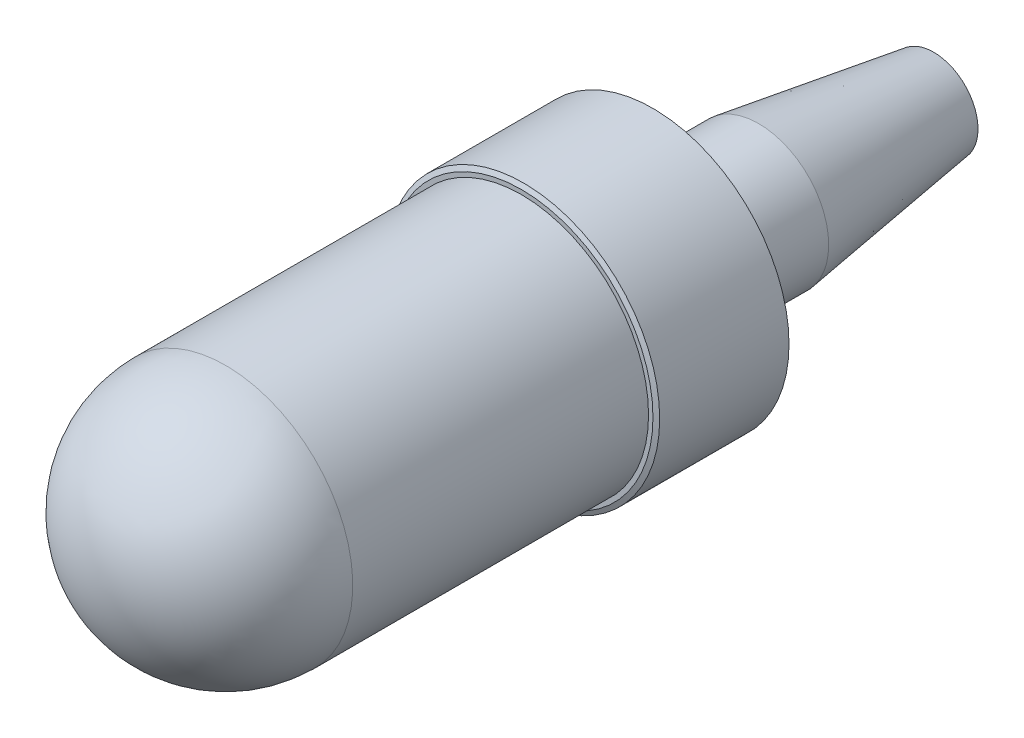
ISO-10303-21;
HEADER;
FILE_DESCRIPTION(('STEP AP214'),'2;1');
FILE_NAME('part.step','',(''),(''),'','','');
FILE_SCHEMA(('AUTOMOTIVE_DESIGN { 1 0 10303 214 1 1 1 1 }'));
ENDSEC;
DATA;
#1=APPLICATION_CONTEXT('core data for automotive mechanical design processes');
#2=APPLICATION_PROTOCOL_DEFINITION('international standard','automotive_design',2000,#1);
#3=PRODUCT_CONTEXT('',#1,'mechanical');
#4=PRODUCT('Part','Part','',(#3));
#5=PRODUCT_RELATED_PRODUCT_CATEGORY('part','',(#4));
#6=PRODUCT_DEFINITION_FORMATION('','',#4);
#7=PRODUCT_DEFINITION_CONTEXT('part definition',#1,'design');
#8=PRODUCT_DEFINITION('design','',#6,#7);
#9=PRODUCT_DEFINITION_SHAPE('','',#8);
#10=(LENGTH_UNIT() NAMED_UNIT(*) SI_UNIT(.MILLI.,.METRE.));
#11=(NAMED_UNIT(*) PLANE_ANGLE_UNIT() SI_UNIT($,.RADIAN.));
#12=(NAMED_UNIT(*) SI_UNIT($,.STERADIAN.) SOLID_ANGLE_UNIT());
#13=UNCERTAINTY_MEASURE_WITH_UNIT(LENGTH_MEASURE(1.E-05),#10,'distance_accuracy_value','');
#14=(GEOMETRIC_REPRESENTATION_CONTEXT(3) GLOBAL_UNCERTAINTY_ASSIGNED_CONTEXT((#13)) GLOBAL_UNIT_ASSIGNED_CONTEXT((#10,
#11,#12)) REPRESENTATION_CONTEXT('',''));
#15=CARTESIAN_POINT('',(0.,0.,0.));
#16=DIRECTION('',(0.,0.,1.));
#17=DIRECTION('',(1.,0.,0.));
#18=AXIS2_PLACEMENT_3D('',#15,#16,#17);
#19=CARTESIAN_POINT('',(3.33066907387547E-13,0.,23.749));
#20=DIRECTION('',(0.,0.,-1.));
#21=DIRECTION('',(-1.,0.,0.));
#22=AXIS2_PLACEMENT_3D('',#19,#20,#21);
#23=CYLINDRICAL_SURFACE('',#22,24.1935);
#24=CARTESIAN_POINT('',(0.,0.,0.380999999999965));
#25=DIRECTION('',(0.,0.,1.));
#26=DIRECTION('',(1.,0.,0.));
#27=AXIS2_PLACEMENT_3D('',#24,#25,#26);
#28=CIRCLE('',#27,24.1935);
#29=CARTESIAN_POINT('',(24.1935,0.,0.380999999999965));
#30=VERTEX_POINT('',#29);
#31=EDGE_CURVE('E45',#30,#30,#28,.T.);
#32=ORIENTED_EDGE('',*,*,#31,.T.);
#33=EDGE_LOOP('',(#32));
#34=FACE_BOUND('',#33,.T.);
#35=CARTESIAN_POINT('',(3.33066907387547E-13,0.,23.368));
#36=DIRECTION('',(0.,0.,1.));
#37=DIRECTION('',(1.,0.,0.));
#38=AXIS2_PLACEMENT_3D('',#35,#36,#37);
#39=CIRCLE('',#38,24.1935);
#40=CARTESIAN_POINT('',(24.1935000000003,0.,23.368));
#41=VERTEX_POINT('',#40);
#42=EDGE_CURVE('E49',#41,#41,#39,.F.);
#43=ORIENTED_EDGE('',*,*,#42,.T.);
#44=EDGE_LOOP('',(#43));
#45=FACE_BOUND('',#44,.T.);
#46=ADVANCED_FACE('F35',(#34,#45),#23,.T.);
#47=CARTESIAN_POINT('',(3.33066907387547E-13,0.,23.749));
#48=DIRECTION('',(0.,0.,1.));
#49=DIRECTION('',(1.,0.,0.));
#50=AXIS2_PLACEMENT_3D('',#47,#48,#49);
#51=PLANE('',#50);
#52=CARTESIAN_POINT('',(3.33066907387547E-13,0.,23.749));
#53=DIRECTION('',(0.,0.,1.));
#54=DIRECTION('',(1.,0.,0.));
#55=AXIS2_PLACEMENT_3D('',#52,#53,#54);
#56=CIRCLE('',#55,22.5933);
#57=CARTESIAN_POINT('',(22.5933000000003,0.,23.749));
#58=VERTEX_POINT('',#57);
#59=EDGE_CURVE('E10',#58,#58,#56,.T.);
#60=ORIENTED_EDGE('',*,*,#59,.F.);
#61=EDGE_LOOP('',(#60));
#62=FACE_BOUND('',#61,.T.);
#63=CARTESIAN_POINT('',(3.33066907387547E-13,0.,23.749));
#64=DIRECTION('',(0.,0.,1.));
#65=DIRECTION('',(1.,0.,0.));
#66=AXIS2_PLACEMENT_3D('',#63,#64,#65);
#67=CIRCLE('',#66,23.3764428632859);
#68=CARTESIAN_POINT('',(23.3764428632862,0.,23.749));
#69=VERTEX_POINT('',#68);
#70=EDGE_CURVE('E54',#69,#69,#67,.T.);
#71=ORIENTED_EDGE('',*,*,#70,.T.);
#72=EDGE_LOOP('',(#71));
#73=FACE_BOUND('',#72,.T.);
#74=ADVANCED_FACE('F94',(#62,#73),#51,.T.);
#75=CARTESIAN_POINT('',(0.,0.,0.));
#76=DIRECTION('',(0.,0.,1.));
#77=DIRECTION('',(1.,0.,0.));
#78=AXIS2_PLACEMENT_3D('',#75,#76,#77);
#79=PLANE('',#78);
#80=CARTESIAN_POINT('',(-18.8976000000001,0.,0.));
#81=DIRECTION('',(0.,0.,-1.));
#82=DIRECTION('',(1.,0.,0.));
#83=AXIS2_PLACEMENT_3D('',#80,#81,#82);
#84=CIRCLE('',#83,2.2225);
#85=CARTESIAN_POINT('',(-16.6751000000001,0.,0.));
#86=VERTEX_POINT('',#85);
#87=EDGE_CURVE('E84',#86,#86,#84,.T.);
#88=ORIENTED_EDGE('',*,*,#87,.F.);
#89=EDGE_LOOP('',(#88));
#90=FACE_BOUND('',#89,.T.);
#91=CARTESIAN_POINT('',(18.8976,0.,0.));
#92=DIRECTION('',(0.,0.,-1.));
#93=DIRECTION('',(-1.,0.,0.));
#94=AXIS2_PLACEMENT_3D('',#91,#92,#93);
#95=CIRCLE('',#94,2.2225);
#96=CARTESIAN_POINT('',(16.6751,0.,0.));
#97=VERTEX_POINT('',#96);
#98=EDGE_CURVE('E78',#97,#97,#95,.T.);
#99=ORIENTED_EDGE('',*,*,#98,.F.);
#100=EDGE_LOOP('',(#99));
#101=FACE_BOUND('',#100,.T.);
#102=CARTESIAN_POINT('',(0.,0.,0.));
#103=DIRECTION('',(0.,0.,1.));
#104=DIRECTION('',(1.,0.,0.));
#105=AXIS2_PLACEMENT_3D('',#102,#103,#104);
#106=CIRCLE('',#105,12.446);
#107=CARTESIAN_POINT('',(12.446,0.,0.));
#108=VERTEX_POINT('',#107);
#109=EDGE_CURVE('E66',#108,#108,#106,.T.);
#110=ORIENTED_EDGE('',*,*,#109,.T.);
#111=EDGE_LOOP('',(#110));
#112=FACE_BOUND('',#111,.T.);
#113=CARTESIAN_POINT('',(0.,0.,0.));
#114=DIRECTION('',(0.,0.,1.));
#115=DIRECTION('',(1.,0.,0.));
#116=AXIS2_PLACEMENT_3D('',#113,#114,#115);
#117=CIRCLE('',#116,23.3764428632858);
#118=CARTESIAN_POINT('',(23.3764428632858,0.,0.));
#119=VERTEX_POINT('',#118);
#120=EDGE_CURVE('E41',#119,#119,#117,.F.);
#121=ORIENTED_EDGE('',*,*,#120,.T.);
#122=EDGE_LOOP('',(#121));
#123=FACE_BOUND('',#122,.T.);
#124=ADVANCED_FACE('F90',(#90,#101,#112,#123),#79,.F.);
#125=CARTESIAN_POINT('',(3.33066907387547E-13,0.,23.749));
#126=DIRECTION('',(0.,0.,-1.));
#127=DIRECTION('',(-1.,0.,0.));
#128=AXIS2_PLACEMENT_3D('',#125,#126,#127);
#129=CONICAL_SURFACE('',#128,23.3764428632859,1.13446401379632);
#130=ORIENTED_EDGE('',*,*,#42,.F.);
#131=EDGE_LOOP('',(#130));
#132=FACE_BOUND('',#131,.T.);
#133=ORIENTED_EDGE('',*,*,#70,.F.);
#134=EDGE_LOOP('',(#133));
#135=FACE_BOUND('',#134,.T.);
#136=ADVANCED_FACE('F93',(#132,#135),#129,.T.);
#137=CARTESIAN_POINT('',(0.,0.,0.380999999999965));
#138=DIRECTION('',(0.,0.,1.));
#139=DIRECTION('',(1.,0.,0.));
#140=AXIS2_PLACEMENT_3D('',#137,#138,#139);
#141=CONICAL_SURFACE('',#140,24.1935,1.13446401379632);
#142=ORIENTED_EDGE('',*,*,#120,.F.);
#143=EDGE_LOOP('',(#142));
#144=FACE_BOUND('',#143,.T.);
#145=ORIENTED_EDGE('',*,*,#31,.F.);
#146=EDGE_LOOP('',(#145));
#147=FACE_BOUND('',#146,.T.);
#148=ADVANCED_FACE('F128',(#144,#147),#141,.T.);
#149=CARTESIAN_POINT('',(0.,0.,0.));
#150=DIRECTION('',(0.,0.,-1.));
#151=DIRECTION('',(-1.,0.,0.));
#152=AXIS2_PLACEMENT_3D('',#149,#150,#151);
#153=CYLINDRICAL_SURFACE('',#152,22.5933);
#154=CARTESIAN_POINT('',(-5.55111512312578E-13,0.,76.327));
#155=DIRECTION('',(0.,0.,-1.));
#156=DIRECTION('',(-1.,0.,0.));
#157=AXIS2_PLACEMENT_3D('',#154,#155,#156);
#158=CIRCLE('',#157,22.5933);
#159=CARTESIAN_POINT('',(-22.5933000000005,0.,76.327));
#160=VERTEX_POINT('',#159);
#161=EDGE_CURVE('E63',#160,#160,#158,.T.);
#162=ORIENTED_EDGE('',*,*,#161,.T.);
#163=EDGE_LOOP('',(#162));
#164=FACE_BOUND('',#163,.T.);
#165=ORIENTED_EDGE('',*,*,#59,.T.);
#166=EDGE_LOOP('',(#165));
#167=FACE_BOUND('',#166,.T.);
#168=ADVANCED_FACE('F113',(#164,#167),#153,.T.);
#169=CARTESIAN_POINT('',(-4.44089209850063E-13,0.,76.327));
#170=DIRECTION('',(0.,0.,-1.));
#171=DIRECTION('',(-1.,0.,0.));
#172=AXIS2_PLACEMENT_3D('',#169,#170,#171);
#173=SPHERICAL_SURFACE('',#172,22.5933);
#174=ORIENTED_EDGE('',*,*,#161,.F.);
#175=EDGE_LOOP('',(#174));
#176=FACE_BOUND('',#175,.T.);
#177=ADVANCED_FACE('F103',(#176),#173,.T.);
#178=CARTESIAN_POINT('',(0.,0.,0.));
#179=DIRECTION('',(0.,0.,1.));
#180=DIRECTION('',(1.,0.,0.));
#181=AXIS2_PLACEMENT_3D('',#178,#179,#180);
#182=CYLINDRICAL_SURFACE('',#181,12.446);
#183=CARTESIAN_POINT('',(0.,0.,-18.4150000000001));
#184=DIRECTION('',(0.,0.,1.));
#185=DIRECTION('',(1.,0.,0.));
#186=AXIS2_PLACEMENT_3D('',#183,#184,#185);
#187=CIRCLE('',#186,12.446);
#188=CARTESIAN_POINT('',(12.446,0.,-18.4150000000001));
#189=VERTEX_POINT('',#188);
#190=EDGE_CURVE('E69',#189,#189,#187,.T.);
#191=ORIENTED_EDGE('',*,*,#190,.T.);
#192=EDGE_LOOP('',(#191));
#193=FACE_BOUND('',#192,.T.);
#194=ORIENTED_EDGE('',*,*,#109,.F.);
#195=EDGE_LOOP('',(#194));
#196=FACE_BOUND('',#195,.T.);
#197=ADVANCED_FACE('F100',(#193,#196),#182,.T.);
#198=CARTESIAN_POINT('',(0.,0.,-18.4150000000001));
#199=DIRECTION('',(0.,0.,1.));
#200=DIRECTION('',(1.,0.,0.));
#201=AXIS2_PLACEMENT_3D('',#198,#199,#200);
#202=CONICAL_SURFACE('',#201,12.446,0.145894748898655);
#203=CARTESIAN_POINT('',(-5.55111512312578E-13,0.,-49.5300000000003));
#204=DIRECTION('',(0.,0.,1.));
#205=DIRECTION('',(1.,0.,0.));
#206=AXIS2_PLACEMENT_3D('',#203,#204,#205);
#207=CIRCLE('',#206,7.874);
#208=CARTESIAN_POINT('',(7.87399999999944,0.,-49.5300000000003));
#209=VERTEX_POINT('',#208);
#210=EDGE_CURVE('E72',#209,#209,#207,.T.);
#211=ORIENTED_EDGE('',*,*,#210,.T.);
#212=EDGE_LOOP('',(#211));
#213=FACE_BOUND('',#212,.T.);
#214=ORIENTED_EDGE('',*,*,#190,.F.);
#215=EDGE_LOOP('',(#214));
#216=FACE_BOUND('',#215,.T.);
#217=ADVANCED_FACE('F102',(#213,#216),#202,.T.);
#218=CARTESIAN_POINT('',(7.87399999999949,0.,-49.5300000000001));
#219=DIRECTION('',(0.,0.,-1.));
#220=DIRECTION('',(-1.,0.,0.));
#221=AXIS2_PLACEMENT_3D('',#218,#219,#220);
#222=PLANE('',#221);
#223=ORIENTED_EDGE('',*,*,#210,.F.);
#224=EDGE_LOOP('',(#223));
#225=FACE_BOUND('',#224,.T.);
#226=ADVANCED_FACE('F110',(#225),#222,.T.);
#227=CARTESIAN_POINT('',(18.8976,0.,9.52500000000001));
#228=DIRECTION('',(0.,0.,-1.));
#229=DIRECTION('',(-1.,0.,0.));
#230=AXIS2_PLACEMENT_3D('',#227,#228,#229);
#231=CYLINDRICAL_SURFACE('',#230,2.2225);
#232=CARTESIAN_POINT('',(18.8976,0.,9.52500000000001));
#233=DIRECTION('',(0.,0.,-1.));
#234=DIRECTION('',(-1.,0.,0.));
#235=AXIS2_PLACEMENT_3D('',#232,#233,#234);
#236=CIRCLE('',#235,2.2225);
#237=CARTESIAN_POINT('',(16.6751,0.,9.52500000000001));
#238=VERTEX_POINT('',#237);
#239=EDGE_CURVE('E75',#238,#238,#236,.T.);
#240=ORIENTED_EDGE('',*,*,#239,.F.);
#241=EDGE_LOOP('',(#240));
#242=FACE_BOUND('',#241,.T.);
#243=ORIENTED_EDGE('',*,*,#98,.T.);
#244=EDGE_LOOP('',(#243));
#245=FACE_BOUND('',#244,.T.);
#246=ADVANCED_FACE('F187',(#242,#245),#231,.F.);
#247=CARTESIAN_POINT('',(18.8976,0.,9.52500000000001));
#248=DIRECTION('',(0.,0.,-1.));
#249=DIRECTION('',(-1.,0.,0.));
#250=AXIS2_PLACEMENT_3D('',#247,#248,#249);
#251=PLANE('',#250);
#252=ORIENTED_EDGE('',*,*,#239,.T.);
#253=EDGE_LOOP('',(#252));
#254=FACE_BOUND('',#253,.T.);
#255=ADVANCED_FACE('F197',(#254),#251,.T.);
#256=CARTESIAN_POINT('',(-18.8975999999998,0.,9.52500000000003));
#257=DIRECTION('',(0.,0.,-1.));
#258=DIRECTION('',(-1.,0.,0.));
#259=AXIS2_PLACEMENT_3D('',#256,#257,#258);
#260=CYLINDRICAL_SURFACE('',#259,2.2225);
#261=CARTESIAN_POINT('',(-18.8975999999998,0.,9.52500000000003));
#262=DIRECTION('',(0.,0.,-1.));
#263=DIRECTION('',(1.,0.,0.));
#264=AXIS2_PLACEMENT_3D('',#261,#262,#263);
#265=CIRCLE('',#264,2.2225);
#266=CARTESIAN_POINT('',(-16.6750999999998,0.,9.52500000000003));
#267=VERTEX_POINT('',#266);
#268=EDGE_CURVE('E81',#267,#267,#265,.T.);
#269=ORIENTED_EDGE('',*,*,#268,.F.);
#270=EDGE_LOOP('',(#269));
#271=FACE_BOUND('',#270,.T.);
#272=ORIENTED_EDGE('',*,*,#87,.T.);
#273=EDGE_LOOP('',(#272));
#274=FACE_BOUND('',#273,.T.);
#275=ADVANCED_FACE('F88',(#271,#274),#260,.F.);
#276=CARTESIAN_POINT('',(-18.8975999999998,0.,9.52500000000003));
#277=DIRECTION('',(0.,0.,1.));
#278=DIRECTION('',(1.,0.,0.));
#279=AXIS2_PLACEMENT_3D('',#276,#277,#278);
#280=PLANE('',#279);
#281=ORIENTED_EDGE('',*,*,#268,.T.);
#282=EDGE_LOOP('',(#281));
#283=FACE_BOUND('',#282,.T.);
#284=ADVANCED_FACE('F216',(#283),#280,.F.);
#285=CLOSED_SHELL('',(#46,#74,#124,#136,#148,#168,#177,#197,#217,#226,#246,#255,#275,#284));
#286=CARTESIAN_POINT('',(-4.44089209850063E-13,0.,76.327));
#287=DIRECTION('',(0.,0.,-1.));
#288=DIRECTION('',(-1.,0.,0.));
#289=AXIS2_PLACEMENT_3D('',#286,#287,#288);
#290=SPHERICAL_SURFACE('',#289,21.3233);
#291=CARTESIAN_POINT('',(-5.55111512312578E-13,0.,76.327));
#292=DIRECTION('',(0.,0.,-1.));
#293=DIRECTION('',(-1.,0.,0.));
#294=AXIS2_PLACEMENT_3D('',#291,#292,#293);
#295=CIRCLE('',#294,21.3233);
#296=CARTESIAN_POINT('',(-21.3233000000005,0.,76.327));
#297=VERTEX_POINT('',#296);
#298=EDGE_CURVE('E57',#297,#297,#295,.T.);
#299=ORIENTED_EDGE('',*,*,#298,.T.);
#300=EDGE_LOOP('',(#299));
#301=FACE_BOUND('',#300,.T.);
#302=ADVANCED_FACE('F138',(#301),#290,.F.);
#303=CARTESIAN_POINT('',(0.,0.,0.));
#304=DIRECTION('',(0.,0.,-1.));
#305=DIRECTION('',(-1.,0.,0.));
#306=AXIS2_PLACEMENT_3D('',#303,#304,#305);
#307=CYLINDRICAL_SURFACE('',#306,21.3233);
#308=CARTESIAN_POINT('',(3.33066907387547E-13,0.,25.0189999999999));
#309=DIRECTION('',(0.,0.,-1.));
#310=DIRECTION('',(-1.,0.,0.));
#311=AXIS2_PLACEMENT_3D('',#308,#309,#310);
#312=CIRCLE('',#311,21.3233);
#313=CARTESIAN_POINT('',(-21.3232999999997,0.,25.0189999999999));
#314=VERTEX_POINT('',#313);
#315=EDGE_CURVE('E60',#314,#314,#312,.T.);
#316=ORIENTED_EDGE('',*,*,#315,.T.);
#317=EDGE_LOOP('',(#316));
#318=FACE_BOUND('',#317,.T.);
#319=ORIENTED_EDGE('',*,*,#298,.F.);
#320=EDGE_LOOP('',(#319));
#321=FACE_BOUND('',#320,.T.);
#322=ADVANCED_FACE('F141',(#318,#321),#307,.F.);
#323=CARTESIAN_POINT('',(-21.3232999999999,0.,25.0189999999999));
#324=DIRECTION('',(0.,0.,1.));
#325=DIRECTION('',(1.,0.,0.));
#326=AXIS2_PLACEMENT_3D('',#323,#324,#325);
#327=PLANE('',#326);
#328=ORIENTED_EDGE('',*,*,#315,.F.);
#329=EDGE_LOOP('',(#328));
#330=FACE_BOUND('',#329,.T.);
#331=ADVANCED_FACE('F146',(#330),#327,.T.);
#332=CLOSED_SHELL('',(#302,#322,#331));
#333=ORIENTED_CLOSED_SHELL('',*,#332,.T.);
#334=BREP_WITH_VOIDS('B2',#285,(#333));
#335=ADVANCED_BREP_SHAPE_REPRESENTATION('',(#18,#334),#14);
#336=SHAPE_DEFINITION_REPRESENTATION(#9,#335);
ENDSEC;
END-ISO-10303-21;
